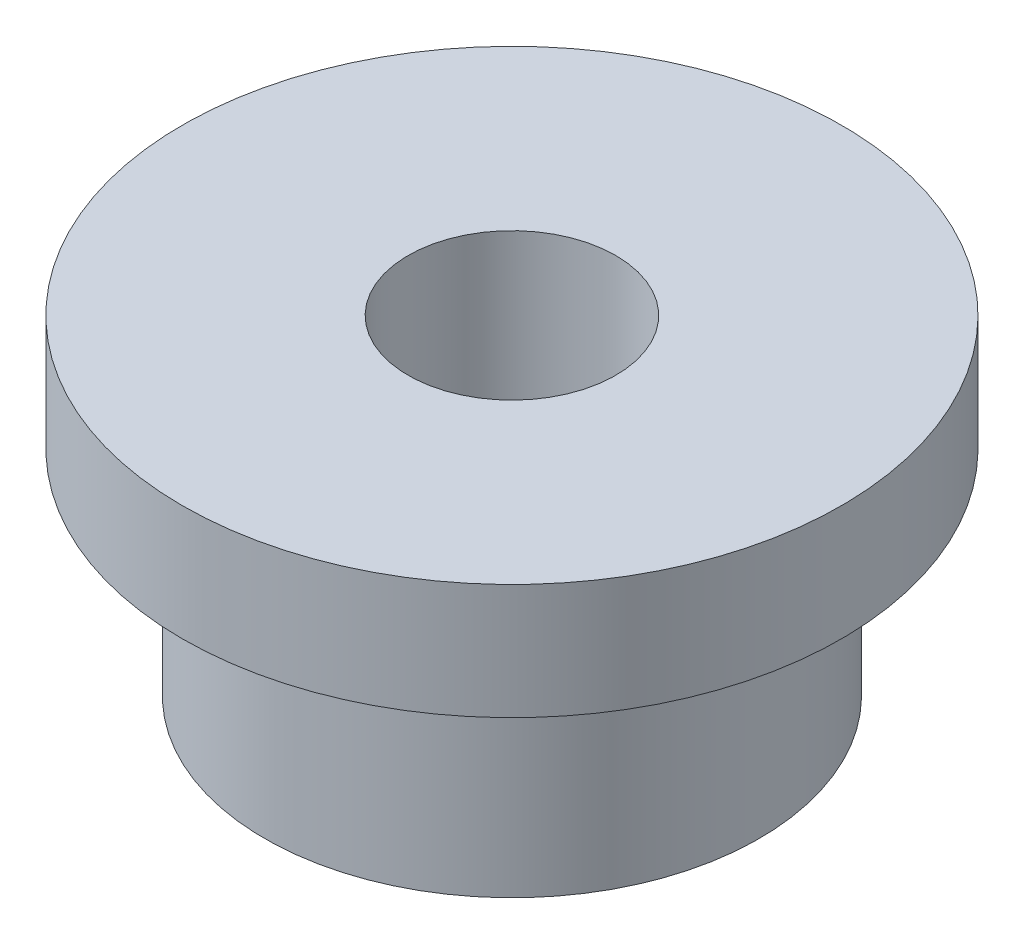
from build123d import *

# Parameters (mm, degrees)
SKETCH1_R           = 7.5
SKETCH1_R_2         = 3.15
BOSS_EXTRUDE1_DEPTH = 6.5
SKETCH2_R           = 10
SKETCH2_R_2         = 3.15
BOSS_EXTRUDE2_DEPTH = 3.5


with BuildPart() as part:
    # Sketch1 → Boss-Extrude1 (new body)
    with BuildSketch(Plane(origin=(0, 0, 0), x_dir=(1, 0, 0), z_dir=(0, 1, 0))):
        with Locations(Location((0, 0, 0), (0, 0, 90))):
            Circle(SKETCH1_R)
        with Locations(Location((0, 0, 0), (0, 0, 90))):
            Circle(SKETCH1_R_2, mode=Mode.SUBTRACT)
    extrude(amount=BOSS_EXTRUDE1_DEPTH)

    # Sketch2 → Boss-Extrude2 (add)
    with BuildSketch(Plane(origin=(0, 6.5, 0), x_dir=(1, 0, 0), z_dir=(0, 1, 0))):
        with Locations(Location((0, 0, 0), (0, 0, 270))):
            Circle(SKETCH2_R)
        with Locations(Location((0, 0, 0), (0, 0, 90))):
            Circle(SKETCH2_R_2, mode=Mode.SUBTRACT)
    extrude(amount=BOSS_EXTRUDE2_DEPTH)


solid = part.part
